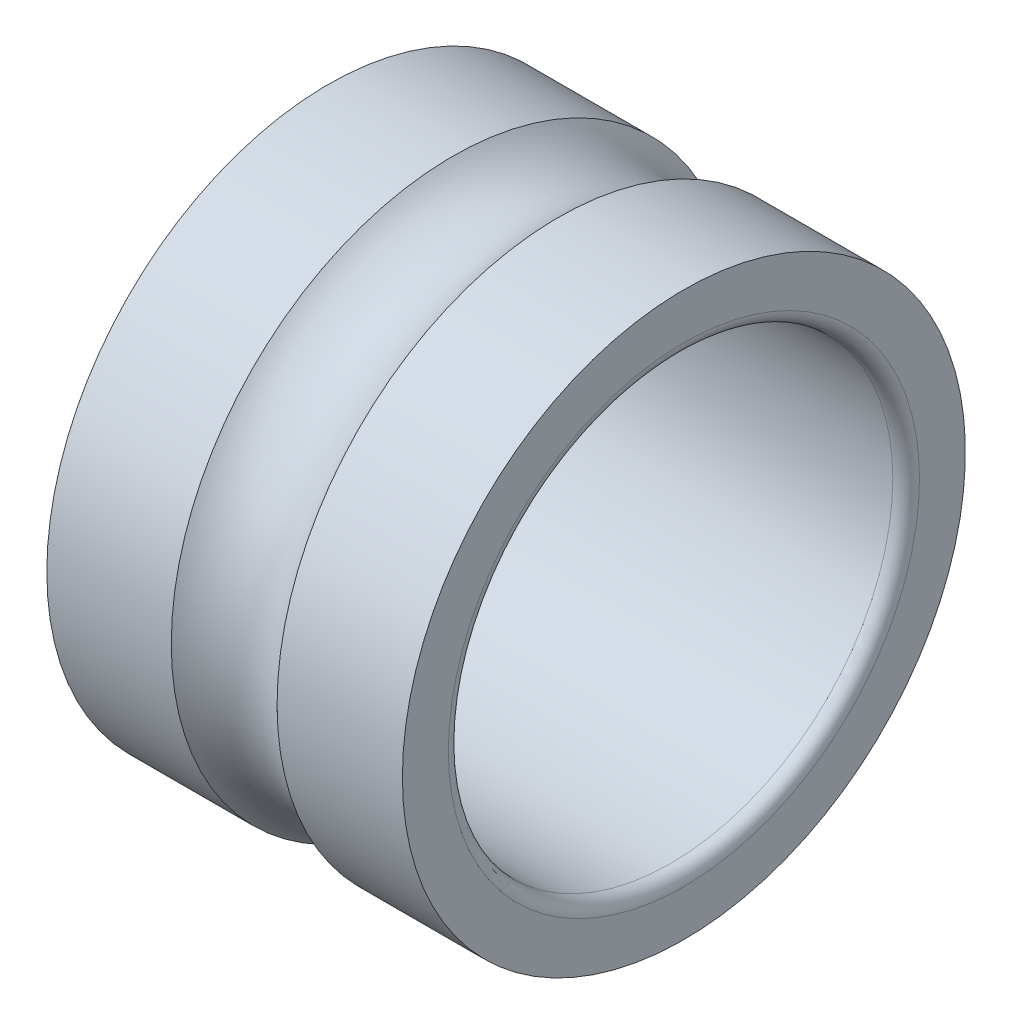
ISO-10303-21;
HEADER;
FILE_DESCRIPTION(('STEP AP214'),'2;1');
FILE_NAME('part.step','',(''),(''),'','','');
FILE_SCHEMA(('AUTOMOTIVE_DESIGN { 1 0 10303 214 1 1 1 1 }'));
ENDSEC;
DATA;
#1=APPLICATION_CONTEXT('core data for automotive mechanical design processes');
#2=APPLICATION_PROTOCOL_DEFINITION('international standard','automotive_design',2000,#1);
#3=PRODUCT_CONTEXT('',#1,'mechanical');
#4=PRODUCT('Part','Part','',(#3));
#5=PRODUCT_RELATED_PRODUCT_CATEGORY('part','',(#4));
#6=PRODUCT_DEFINITION_FORMATION('','',#4);
#7=PRODUCT_DEFINITION_CONTEXT('part definition',#1,'design');
#8=PRODUCT_DEFINITION('design','',#6,#7);
#9=PRODUCT_DEFINITION_SHAPE('','',#8);
#10=(LENGTH_UNIT() NAMED_UNIT(*) SI_UNIT(.MILLI.,.METRE.));
#11=(NAMED_UNIT(*) PLANE_ANGLE_UNIT() SI_UNIT($,.RADIAN.));
#12=(NAMED_UNIT(*) SI_UNIT($,.STERADIAN.) SOLID_ANGLE_UNIT());
#13=UNCERTAINTY_MEASURE_WITH_UNIT(LENGTH_MEASURE(1.E-05),#10,'distance_accuracy_value','');
#14=(GEOMETRIC_REPRESENTATION_CONTEXT(3) GLOBAL_UNCERTAINTY_ASSIGNED_CONTEXT((#13)) GLOBAL_UNIT_ASSIGNED_CONTEXT((#10,
#11,#12)) REPRESENTATION_CONTEXT('',''));
#15=CARTESIAN_POINT('',(0.,0.,0.));
#16=DIRECTION('',(0.,0.,1.));
#17=DIRECTION('',(1.,0.,0.));
#18=AXIS2_PLACEMENT_3D('',#15,#16,#17);
#19=CARTESIAN_POINT('',(3.3548809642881,0.,0.));
#20=DIRECTION('',(-1.,0.,0.));
#21=DIRECTION('',(0.,0.,1.));
#22=AXIS2_PLACEMENT_3D('',#19,#20,#21);
#23=TOROIDAL_SURFACE('',#22,2.65,0.15);
#24=CARTESIAN_POINT('',(3.3548809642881,0.,0.));
#25=DIRECTION('',(-1.,0.,0.));
#26=DIRECTION('',(0.,0.,1.));
#27=AXIS2_PLACEMENT_3D('',#24,#25,#26);
#28=CIRCLE('',#27,2.5);
#29=CARTESIAN_POINT('',(3.3548809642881,0.,2.5));
#30=VERTEX_POINT('',#29);
#31=EDGE_CURVE('E10',#30,#30,#28,.T.);
#32=ORIENTED_EDGE('',*,*,#31,.T.);
#33=EDGE_LOOP('',(#32));
#34=FACE_BOUND('',#33,.T.);
#35=CARTESIAN_POINT('',(3.5048809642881,0.,0.));
#36=DIRECTION('',(-1.,0.,0.));
#37=DIRECTION('',(0.,0.,1.));
#38=AXIS2_PLACEMENT_3D('',#35,#36,#37);
#39=CIRCLE('',#38,2.65);
#40=CARTESIAN_POINT('',(3.5048809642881,0.,2.65));
#41=VERTEX_POINT('',#40);
#42=EDGE_CURVE('E58',#41,#41,#39,.T.);
#43=ORIENTED_EDGE('',*,*,#42,.F.);
#44=EDGE_LOOP('',(#43));
#45=FACE_BOUND('',#44,.T.);
#46=ADVANCED_FACE('F30',(#34,#45),#23,.T.);
#47=CARTESIAN_POINT('',(3.,0.,0.));
#48=DIRECTION('',(-1.,0.,0.));
#49=DIRECTION('',(0.,0.,1.));
#50=AXIS2_PLACEMENT_3D('',#47,#48,#49);
#51=CYLINDRICAL_SURFACE('',#50,2.5);
#52=CARTESIAN_POINT('',(-0.345119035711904,0.,0.));
#53=DIRECTION('',(-1.,0.,0.));
#54=DIRECTION('',(0.,0.,1.));
#55=AXIS2_PLACEMENT_3D('',#52,#53,#54);
#56=CIRCLE('',#55,2.5);
#57=CARTESIAN_POINT('',(-0.345119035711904,0.,2.5));
#58=VERTEX_POINT('',#57);
#59=EDGE_CURVE('E36',#58,#58,#56,.T.);
#60=ORIENTED_EDGE('',*,*,#59,.T.);
#61=EDGE_LOOP('',(#60));
#62=FACE_BOUND('',#61,.T.);
#63=ORIENTED_EDGE('',*,*,#31,.F.);
#64=EDGE_LOOP('',(#63));
#65=FACE_BOUND('',#64,.T.);
#66=ADVANCED_FACE('F66',(#62,#65),#51,.F.);
#67=CARTESIAN_POINT('',(-0.345119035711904,0.,0.));
#68=DIRECTION('',(-1.,0.,0.));
#69=DIRECTION('',(0.,0.,1.));
#70=AXIS2_PLACEMENT_3D('',#67,#68,#69);
#71=TOROIDAL_SURFACE('',#70,2.65,0.15);
#72=CARTESIAN_POINT('',(-0.495119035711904,0.,0.));
#73=DIRECTION('',(-1.,0.,0.));
#74=DIRECTION('',(0.,0.,1.));
#75=AXIS2_PLACEMENT_3D('',#72,#73,#74);
#76=CIRCLE('',#75,2.65);
#77=CARTESIAN_POINT('',(-0.495119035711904,0.,2.65));
#78=VERTEX_POINT('',#77);
#79=EDGE_CURVE('E40',#78,#78,#76,.T.);
#80=ORIENTED_EDGE('',*,*,#79,.T.);
#81=EDGE_LOOP('',(#80));
#82=FACE_BOUND('',#81,.T.);
#83=ORIENTED_EDGE('',*,*,#59,.F.);
#84=EDGE_LOOP('',(#83));
#85=FACE_BOUND('',#84,.T.);
#86=ADVANCED_FACE('F70',(#82,#85),#71,.T.);
#87=CARTESIAN_POINT('',(-0.495119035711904,2.65,0.));
#88=DIRECTION('',(-1.,0.,0.));
#89=DIRECTION('',(0.,0.,1.));
#90=AXIS2_PLACEMENT_3D('',#87,#88,#89);
#91=PLANE('',#90);
#92=CARTESIAN_POINT('',(-0.495119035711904,0.,0.));
#93=DIRECTION('',(-1.,0.,0.));
#94=DIRECTION('',(0.,0.,1.));
#95=AXIS2_PLACEMENT_3D('',#92,#93,#94);
#96=CIRCLE('',#95,3.16666666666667);
#97=CARTESIAN_POINT('',(-0.495119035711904,0.,3.16666666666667));
#98=VERTEX_POINT('',#97);
#99=EDGE_CURVE('E44',#98,#98,#96,.T.);
#100=ORIENTED_EDGE('',*,*,#99,.T.);
#101=EDGE_LOOP('',(#100));
#102=FACE_BOUND('',#101,.T.);
#103=ORIENTED_EDGE('',*,*,#79,.F.);
#104=EDGE_LOOP('',(#103));
#105=FACE_BOUND('',#104,.T.);
#106=ADVANCED_FACE('F74',(#102,#105),#91,.T.);
#107=CARTESIAN_POINT('',(3.,0.,0.));
#108=DIRECTION('',(-1.,0.,0.));
#109=DIRECTION('',(0.,0.,1.));
#110=AXIS2_PLACEMENT_3D('',#107,#108,#109);
#111=CYLINDRICAL_SURFACE('',#110,3.16666666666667);
#112=CARTESIAN_POINT('',(0.904880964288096,0.,0.));
#113=DIRECTION('',(-1.,0.,0.));
#114=DIRECTION('',(0.,0.,1.));
#115=AXIS2_PLACEMENT_3D('',#112,#113,#114);
#116=CIRCLE('',#115,3.16666666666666);
#117=CARTESIAN_POINT('',(0.904880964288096,0.,3.16666666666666));
#118=VERTEX_POINT('',#117);
#119=EDGE_CURVE('E49',#118,#118,#116,.T.);
#120=ORIENTED_EDGE('',*,*,#119,.T.);
#121=EDGE_LOOP('',(#120));
#122=FACE_BOUND('',#121,.T.);
#123=ORIENTED_EDGE('',*,*,#99,.F.);
#124=EDGE_LOOP('',(#123));
#125=FACE_BOUND('',#124,.T.);
#126=ADVANCED_FACE('F81',(#122,#125),#111,.T.);
#127=CARTESIAN_POINT('',(1.5,0.,0.));
#128=DIRECTION('',(-1.,0.,0.));
#129=DIRECTION('',(0.,0.,1.));
#130=AXIS2_PLACEMENT_3D('',#127,#128,#129);
#131=TOROIDAL_SURFACE('',#130,3.75,0.833333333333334);
#132=CARTESIAN_POINT('',(2.0951190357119,0.,0.));
#133=DIRECTION('',(-1.,0.,0.));
#134=DIRECTION('',(0.,0.,1.));
#135=AXIS2_PLACEMENT_3D('',#132,#133,#134);
#136=CIRCLE('',#135,3.16666666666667);
#137=CARTESIAN_POINT('',(2.0951190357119,0.,3.16666666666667));
#138=VERTEX_POINT('',#137);
#139=EDGE_CURVE('E52',#138,#138,#136,.T.);
#140=ORIENTED_EDGE('',*,*,#139,.T.);
#141=EDGE_LOOP('',(#140));
#142=FACE_BOUND('',#141,.T.);
#143=ORIENTED_EDGE('',*,*,#119,.F.);
#144=EDGE_LOOP('',(#143));
#145=FACE_BOUND('',#144,.T.);
#146=ADVANCED_FACE('F85',(#142,#145),#131,.F.);
#147=CARTESIAN_POINT('',(3.,0.,0.));
#148=DIRECTION('',(-1.,0.,0.));
#149=DIRECTION('',(0.,0.,1.));
#150=AXIS2_PLACEMENT_3D('',#147,#148,#149);
#151=CYLINDRICAL_SURFACE('',#150,3.16666666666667);
#152=CARTESIAN_POINT('',(3.5048809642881,0.,0.));
#153=DIRECTION('',(-1.,0.,0.));
#154=DIRECTION('',(0.,0.,1.));
#155=AXIS2_PLACEMENT_3D('',#152,#153,#154);
#156=CIRCLE('',#155,3.16666666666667);
#157=CARTESIAN_POINT('',(3.5048809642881,0.,3.16666666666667));
#158=VERTEX_POINT('',#157);
#159=EDGE_CURVE('E55',#158,#158,#156,.T.);
#160=ORIENTED_EDGE('',*,*,#159,.T.);
#161=EDGE_LOOP('',(#160));
#162=FACE_BOUND('',#161,.T.);
#163=ORIENTED_EDGE('',*,*,#139,.F.);
#164=EDGE_LOOP('',(#163));
#165=FACE_BOUND('',#164,.T.);
#166=ADVANCED_FACE('F89',(#162,#165),#151,.T.);
#167=CARTESIAN_POINT('',(3.5048809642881,3.16666666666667,0.));
#168=DIRECTION('',(1.,0.,0.));
#169=DIRECTION('',(0.,0.,-1.));
#170=AXIS2_PLACEMENT_3D('',#167,#168,#169);
#171=PLANE('',#170);
#172=ORIENTED_EDGE('',*,*,#42,.T.);
#173=EDGE_LOOP('',(#172));
#174=FACE_BOUND('',#173,.T.);
#175=ORIENTED_EDGE('',*,*,#159,.F.);
#176=EDGE_LOOP('',(#175));
#177=FACE_BOUND('',#176,.T.);
#178=ADVANCED_FACE('F62',(#174,#177),#171,.T.);
#179=CLOSED_SHELL('',(#46,#66,#86,#106,#126,#146,#166,#178));
#180=MANIFOLD_SOLID_BREP('B2',#179);
#181=ADVANCED_BREP_SHAPE_REPRESENTATION('',(#18,#180),#14);
#182=SHAPE_DEFINITION_REPRESENTATION(#9,#181);
ENDSEC;
END-ISO-10303-21;
